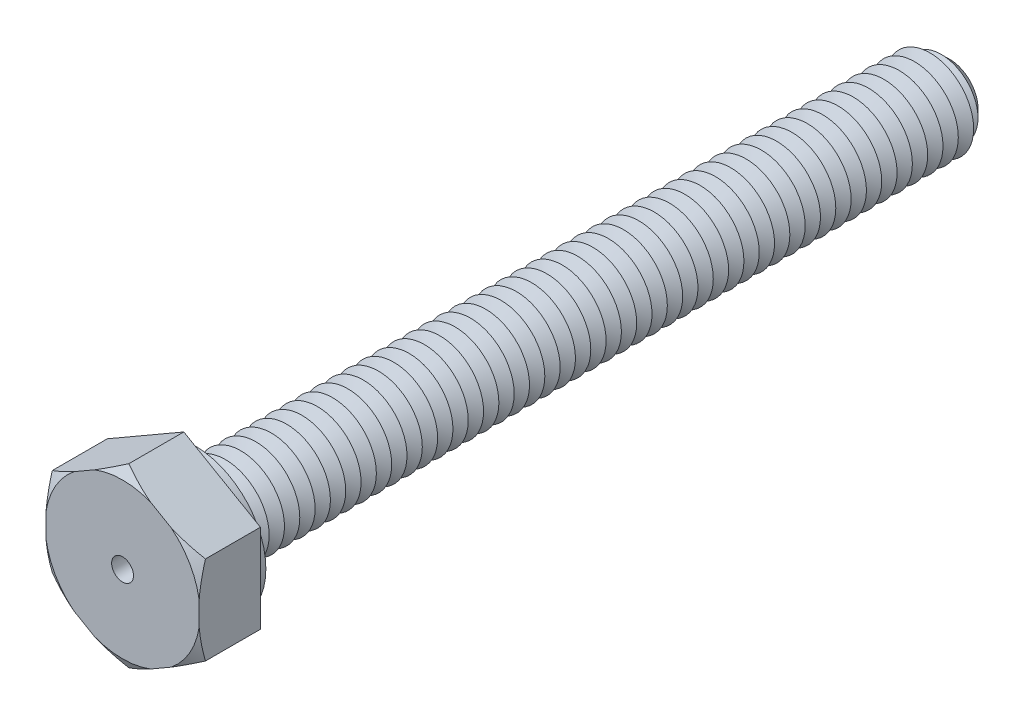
from build123d import *

# Parameters (mm, degrees)
BOSS_EXTRUDE1_DEPTH = 2.8
SKETCH3_R           = 2
BOSS_EXTRUDE2_DEPTH = 35
SKETCH4_R           = 3.25
BOSS_EXTRUDE3_DEPTH = 0.5
CHAMFER1_SIZE       = 0.7
LPATTERN1_COUNT     = 49
LPATTERN1_PITCH     = 0.7
SKETCH8_R           = 0.5
CUT_EXTRUDE1_DEPTH  = 37.8


with BuildPart() as part:
    # Sketch2 → Boss-Extrude1 (new body)
    with BuildSketch(Plane.XY):
        Polygon((0, 4.041451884), (-3.5, 2.020725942), (-3.5, -2.020725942), (0, -4.041451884), (3.5, -2.020725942), (3.5, 2.020725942), align=None)
    extrude(amount=BOSS_EXTRUDE1_DEPTH)

    # Sketch3 → Boss-Extrude2 (add)
    with BuildSketch(Plane(origin=(0, 0, 0), x_dir=(-1, 0, 0), z_dir=(0, 0, -1))):
        Circle(SKETCH3_R)
    extrude(amount=BOSS_EXTRUDE2_DEPTH)

    # Sketch4 → Boss-Extrude3 (add)
    with BuildSketch(Plane(origin=(0, 0, 0), x_dir=(-1, 0, 0), z_dir=(0, 0, -1))):
        with Locations(Location((0, 0, 0), (0, 0, 180))):
            Circle(SKETCH4_R)
    extrude(amount=BOSS_EXTRUDE3_DEPTH)

    # Chamfer1
    chamfer1_edges = [part.edges().sort_by_distance(p)[0] for p in [
        (2, 0, -35),
    ]]
    chamfer(chamfer1_edges, length=CHAMFER1_SIZE)

    # Sketch6 → Cut-Revolve1 (revolve, cut)
    with BuildSketch(Plane(origin=(0, 0, 0), x_dir=(0, 0, -1), z_dir=(1, 0, 0)), mode=Mode.PRIVATE) as cut_revolve1_sk:
        Polygon((0.5, 2), (0.85, 1.393782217), (1.2, 2), align=None)
    cut_revolve1 = revolve(cut_revolve1_sk.sketch.rotate(Axis((0, 0, 3.211670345), (0, 0, -1)), 90), axis=Axis((0, 0, 3.211670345), (0, 0, -1)), mode=Mode.SUBTRACT)

    # LPattern1: Cut-Revolve1 ×49
    with Locations(*[(0, 0, -i * LPATTERN1_PITCH) for i in range(1, LPATTERN1_COUNT)]):
        add(cut_revolve1, mode=Mode.SUBTRACT)

    # Sketch7 → Cut-Revolve2 (revolve, cut)
    with BuildSketch(Plane(origin=(0, 0, 0), x_dir=(0, 0, -1), z_dir=(1, 0, 0)), mode=Mode.PRIVATE) as cut_revolve2_sk:
        Polygon((-2.8, 4.041451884), (-2.8, 3.541451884), (-2.511324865, 4.041451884), align=None)
    revolve(cut_revolve2_sk.sketch.rotate(Axis((0, 0, 3.211670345), (0, 0, -1)), 90), axis=Axis((0, 0, 3.211670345), (0, 0, -1)), mode=Mode.SUBTRACT)

    # Sketch8 → Cut-Extrude1 (cut)
    with BuildSketch(Plane.XY.offset(2.8)):
        Circle(SKETCH8_R)
    extrude(amount=-CUT_EXTRUDE1_DEPTH, mode=Mode.SUBTRACT)


solid = part.part
